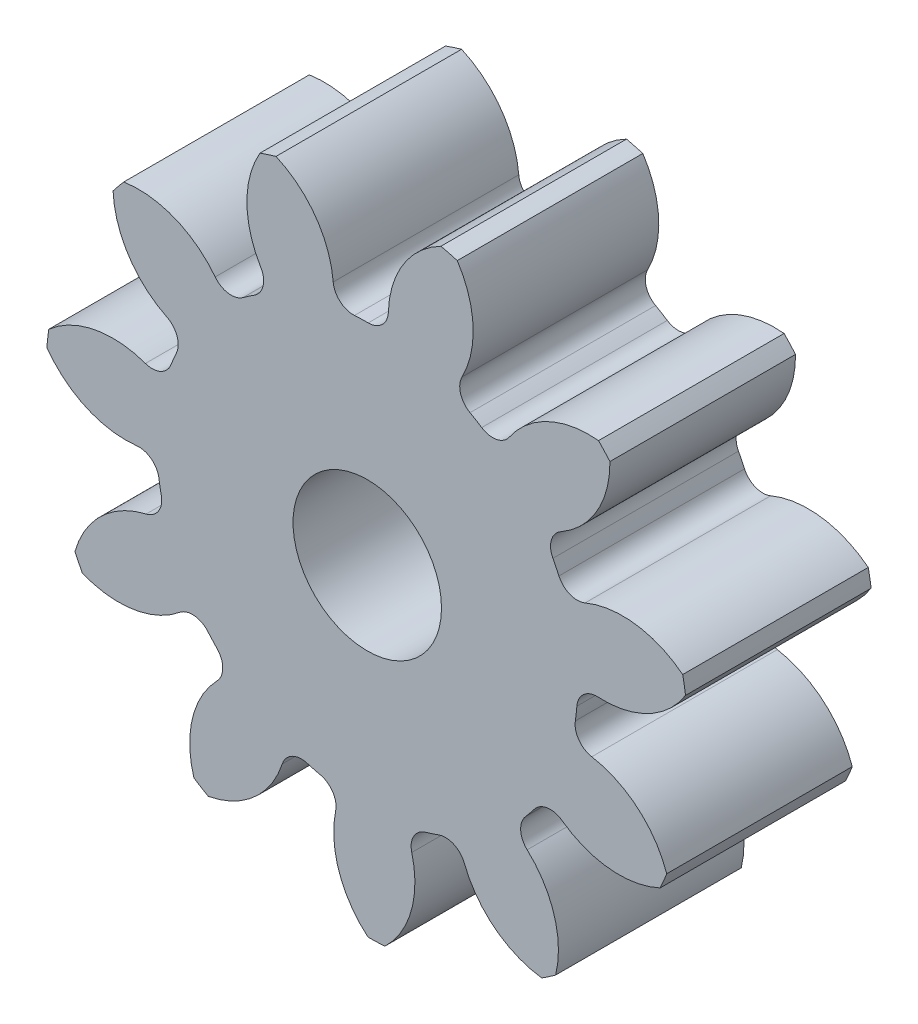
from build123d import *

# Parameters (mm, degrees)
SKETCH3_R         = 220.133333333
GEARBODY_DEPTH    = 127
TOOTHCUT_DEPTH    = 337.223688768
CIRPATTERN1_COUNT = 11
BOREDIA_R         = 50.8
BORE_DEPTH        = 12700


with BuildPart() as part:
    # Sketch3 → gearBody (new body)
    with BuildSketch(Plane.XY):
        Circle(SKETCH3_R)
    extrude(amount=GEARBODY_DEPTH)

    # Sketch2 → toothCut (cut, through all)
    with BuildSketch(Plane.XY):
        with BuildLine():
            ThreePointArc((142.380225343, -21.08733923), (142.990411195, -16.448305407), (143.449488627, -11.791889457))
            ThreePointArc((143.449488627, -11.791889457), (148.138410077, -2.523233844), (157.965861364, 0.840567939))
            ThreePointArc((157.965861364, 0.840567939), (194.146443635, 9.218899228), (220.133333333, 35.750249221))
            ThreePointArc((220.133333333, 35.750249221), (221.556399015, -25.485816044), (206.266411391, -84.799364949))
            ThreePointArc((206.266411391, -84.799364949), (186.982396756, -53.060465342), (153.649160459, -36.685901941))
            ThreePointArc((153.649160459, -36.685901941), (144.842163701, -31.178564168), (142.380225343, -21.08733923))
        make_face()
    toothcut = extrude(amount=TOOTHCUT_DEPTH, mode=Mode.SUBTRACT)

    # CirPattern1: toothCut ×11 about axis
    cirpattern1_axis = Axis((0, 0, 0), (0, 0, 1))
    for i in range(1, CIRPATTERN1_COUNT):
        add(toothcut.rotate(cirpattern1_axis, i * 360 / CIRPATTERN1_COUNT), mode=Mode.SUBTRACT)

    # boreDia → bore (cut, symmetric)
    with BuildSketch(Plane.XY):
        Circle(BOREDIA_R)
    extrude(amount=BORE_DEPTH, both=True, mode=Mode.SUBTRACT)


solid = part.part
